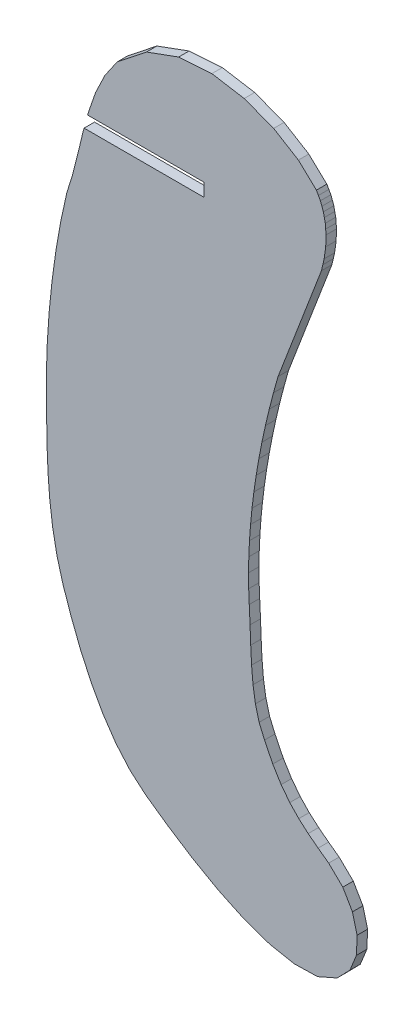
from build123d import *

# Parameters (mm, degrees)
EXTRUDE_1_DEPTH = 2


with BuildPart() as part:
    # Model → Extrude 1 (new body)
    with BuildSketch(Plane.XY):
        Polygon((-5212.5913, 37.1104), (-5212.5403, 39.7904), (-5212.4114, 42.526), (-5212.2056, 45.313), (-5211.9238, 48.1474), (-5211.5671, 51.0252), (-5211.1279, 53.9987), (-5210.613, 57.0087), (-5210.0239, 60.0509), (-5209.3618, 63.1208), (-5208.6274, 66.2141), (-5207.822, 69.3265), (-5206.9468, 72.4538), (-5198.6333, 94.1661), (-5198.3743, 95.2826), (-5198.1152, 96.399), (-5197.8245, 98.5256), (-5197.7559, 100.5307), (-5197.8303, 101.4649), (-5197.9048, 102.3991), (-5198.0854, 103.2575), (-5198.2659, 104.1157), (-5198.5503, 104.8904), (-5198.8345, 105.665), (-5199.22, 106.3485), (-5199.6055, 107.0321), (-5203.0583, 110.2957), (-5207.7881, 113.1763), (-5213.428, 115.3137), (-5219.6101, 116.347), (-5225.9675, 115.916), (-5232.1323, 113.66), (-5237.7378, 109.2189), (-5240.0732, 105.8245), (-5241.8538, 102.1048), (-5243.2202, 98.1782), (-5243.3812, 97.5868), (-5221.0781, 97.5868), (-5221.0781, 97.3368), (-5221.0781, 95.3368), (-5221.0781, 95.0868), (-5244.0614, 95.0868), (-5244.313, 94.1625), (-5245.2729, 90.176), (-5246.2405, 86.3367), (-5247.3562, 82.7632), (-5248.4905, 77.5845), (-5249.4329, 72.2315), (-5250.1833, 66.8022), (-5250.7407, 61.3944), (-5251.1047, 56.1062), (-5251.2749, 51.0358), (-5251.2505, 46.2813), (-5251.2139, 42.4921), (-5251.1353, 38.507), (-5250.9575, 34.3789), (-5250.6238, 30.161), (-5250.0776, 25.9063), (-5249.2622, 21.6681), (-5248.1204, 17.4995), (-5246.4785, 12.7133), (-5244.6631, 8.1146), (-5242.6545, 3.7762), (-5240.4336, -0.2296), (-5237.9807, -3.8301), (-5235.2766, -6.9524), (-5232.3015, -9.5242), (-5227.9434, -12.59), (-5223.2627, -15.6016), (-5218.3845, -18.3698), (-5213.4329, -20.7051), (-5208.5322, -22.418), (-5203.8069, -23.3193), (-5199.3816, -23.2194), (-5195.6477, -21.5771), (-5193.196, -19.0669), (-5191.9434, -15.9698), (-5191.8064, -12.5666), (-5192.7021, -9.1386), (-5194.5474, -5.9669), (-5197.2588, -3.3324), (-5199.2734, -1.8616), (-5201.1733, -0.3996), (-5202.9746, 1.172), (-5204.6943, 2.9716), (-5206.3486, 5.1179), (-5207.9541, 7.7291), (-5209.5278, 10.924), (-5210.5632, 13.3464), (-5211.2747, 16.0529), (-5211.7334, 18.9888), (-5212.0098, 22.0994), (-5212.175, 25.3301), (-5212.2998, 28.6264), (-5212.4551, 31.9335), (-5212.5632, 34.4901), align=None)
    extrude(amount=EXTRUDE_1_DEPTH)


solid = part.part
